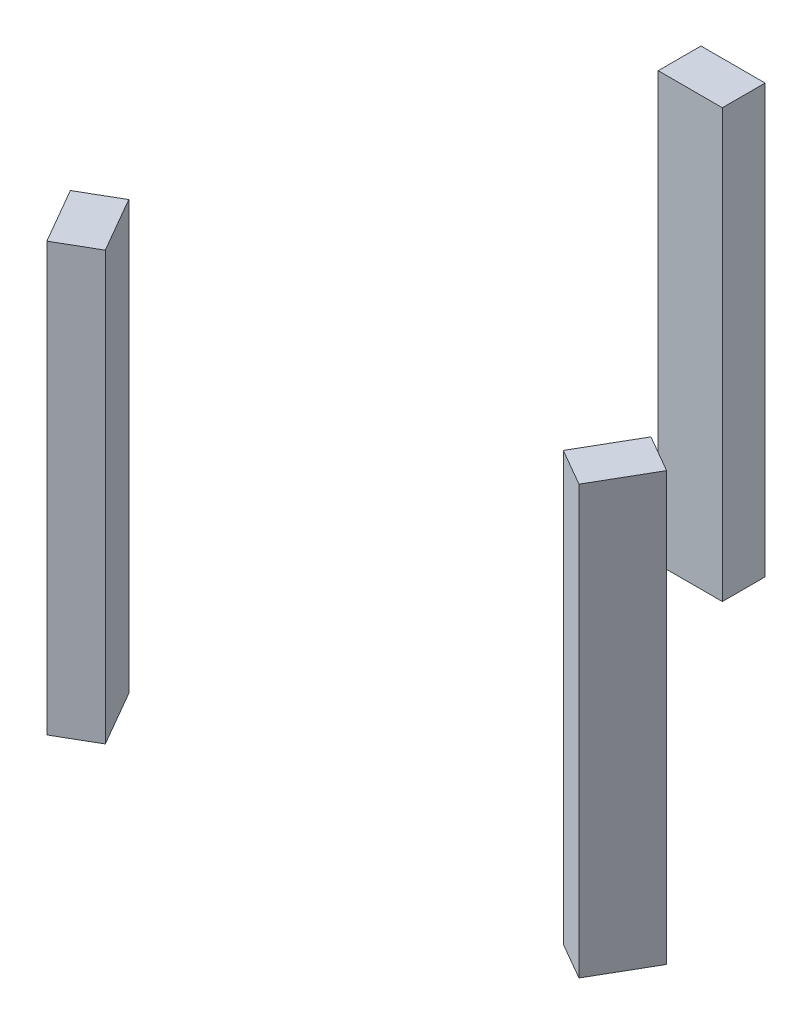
ISO-10303-21;
HEADER;
FILE_DESCRIPTION(('STEP AP214'),'2;1');
FILE_NAME('part.step','',(''),(''),'','','');
FILE_SCHEMA(('AUTOMOTIVE_DESIGN { 1 0 10303 214 1 1 1 1 }'));
ENDSEC;
DATA;
#1=APPLICATION_CONTEXT('core data for automotive mechanical design processes');
#2=APPLICATION_PROTOCOL_DEFINITION('international standard','automotive_design',2000,#1);
#3=PRODUCT_CONTEXT('',#1,'mechanical');
#4=PRODUCT('Part','Part','',(#3));
#5=PRODUCT_RELATED_PRODUCT_CATEGORY('part','',(#4));
#6=PRODUCT_DEFINITION_FORMATION('','',#4);
#7=PRODUCT_DEFINITION_CONTEXT('part definition',#1,'design');
#8=PRODUCT_DEFINITION('design','',#6,#7);
#9=PRODUCT_DEFINITION_SHAPE('','',#8);
#10=(LENGTH_UNIT() NAMED_UNIT(*) SI_UNIT(.MILLI.,.METRE.));
#11=(NAMED_UNIT(*) PLANE_ANGLE_UNIT() SI_UNIT($,.RADIAN.));
#12=(NAMED_UNIT(*) SI_UNIT($,.STERADIAN.) SOLID_ANGLE_UNIT());
#13=UNCERTAINTY_MEASURE_WITH_UNIT(LENGTH_MEASURE(1.E-05),#10,'distance_accuracy_value','');
#14=(GEOMETRIC_REPRESENTATION_CONTEXT(3) GLOBAL_UNCERTAINTY_ASSIGNED_CONTEXT((#13)) GLOBAL_UNIT_ASSIGNED_CONTEXT((#10,
#11,#12)) REPRESENTATION_CONTEXT('',''));
#15=CARTESIAN_POINT('',(0.,0.,0.));
#16=DIRECTION('',(0.,0.,1.));
#17=DIRECTION('',(1.,0.,0.));
#18=AXIS2_PLACEMENT_3D('',#15,#16,#17);
#19=CARTESIAN_POINT('',(133.923048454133,200.,42.67949192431));
#20=DIRECTION('',(0.499999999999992,0.,-0.866025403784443));
#21=DIRECTION('',(-0.866025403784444,0.,-0.499999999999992));
#22=AXIS2_PLACEMENT_3D('',#19,#20,#21);
#23=PLANE('',#22);
#24=DIRECTION('',(0.866025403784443,0.,0.499999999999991));
#25=VECTOR('',#24,1.);
#26=CARTESIAN_POINT('',(133.923048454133,0.,42.67949192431));
#27=LINE('',#26,#25);
#28=CARTESIAN_POINT('',(116.602540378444,0.,32.6794919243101));
#29=VERTEX_POINT('',#28);
#30=CARTESIAN_POINT('',(133.923048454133,0.,42.67949192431));
#31=VERTEX_POINT('',#30);
#32=EDGE_CURVE('E108',#29,#31,#27,.T.);
#33=ORIENTED_EDGE('',*,*,#32,.F.);
#34=DIRECTION('',(0.,-1.,0.));
#35=VECTOR('',#34,1.);
#36=CARTESIAN_POINT('',(116.602540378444,200.,32.6794919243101));
#37=LINE('',#36,#35);
#38=CARTESIAN_POINT('',(116.602540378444,200.,32.6794919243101));
#39=VERTEX_POINT('',#38);
#40=EDGE_CURVE('E12',#39,#29,#37,.T.);
#41=ORIENTED_EDGE('',*,*,#40,.F.);
#42=DIRECTION('',(0.866025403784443,0.,0.499999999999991));
#43=VECTOR('',#42,1.);
#44=CARTESIAN_POINT('',(133.923048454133,200.,42.67949192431));
#45=LINE('',#44,#43);
#46=CARTESIAN_POINT('',(133.923048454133,200.,42.67949192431));
#47=VERTEX_POINT('',#46);
#48=EDGE_CURVE('E102',#39,#47,#45,.T.);
#49=ORIENTED_EDGE('',*,*,#48,.T.);
#50=DIRECTION('',(0.,-1.,0.));
#51=VECTOR('',#50,1.);
#52=CARTESIAN_POINT('',(133.923048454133,200.,42.67949192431));
#53=LINE('',#52,#51);
#54=EDGE_CURVE('E47',#47,#31,#53,.T.);
#55=ORIENTED_EDGE('',*,*,#54,.T.);
#56=EDGE_LOOP('',(#33,#41,#49,#55));
#57=FACE_BOUND('',#56,.T.);
#58=ADVANCED_FACE('F44',(#57),#23,.T.);
#59=CARTESIAN_POINT('',(101.602540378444,200.,58.6602540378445));
#60=DIRECTION('',(-0.866025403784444,0.,-0.49999999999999));
#61=DIRECTION('',(-0.49999999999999,0.,0.866025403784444));
#62=AXIS2_PLACEMENT_3D('',#59,#60,#61);
#63=PLANE('',#62);
#64=DIRECTION('',(0.49999999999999,0.,-0.866025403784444));
#65=VECTOR('',#64,1.);
#66=CARTESIAN_POINT('',(101.602540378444,0.,58.6602540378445));
#67=LINE('',#66,#65);
#68=CARTESIAN_POINT('',(101.602540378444,0.,58.6602540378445));
#69=VERTEX_POINT('',#68);
#70=EDGE_CURVE('E104',#69,#29,#67,.T.);
#71=ORIENTED_EDGE('',*,*,#70,.F.);
#72=DIRECTION('',(0.,-1.,0.));
#73=VECTOR('',#72,1.);
#74=CARTESIAN_POINT('',(101.602540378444,200.,58.6602540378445));
#75=LINE('',#74,#73);
#76=CARTESIAN_POINT('',(101.602540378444,200.,58.6602540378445));
#77=VERTEX_POINT('',#76);
#78=EDGE_CURVE('E53',#77,#69,#75,.T.);
#79=ORIENTED_EDGE('',*,*,#78,.F.);
#80=DIRECTION('',(0.49999999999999,0.,-0.866025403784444));
#81=VECTOR('',#80,1.);
#82=CARTESIAN_POINT('',(101.602540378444,200.,58.6602540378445));
#83=LINE('',#82,#81);
#84=EDGE_CURVE('E99',#77,#39,#83,.T.);
#85=ORIENTED_EDGE('',*,*,#84,.T.);
#86=ORIENTED_EDGE('',*,*,#40,.T.);
#87=EDGE_LOOP('',(#71,#79,#85,#86));
#88=FACE_BOUND('',#87,.T.);
#89=ADVANCED_FACE('F118',(#88),#63,.T.);
#90=CARTESIAN_POINT('',(118.923048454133,200.,68.6602540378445));
#91=DIRECTION('',(-0.5,0.,0.866025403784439));
#92=DIRECTION('',(0.866025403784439,0.,0.5));
#93=AXIS2_PLACEMENT_3D('',#90,#91,#92);
#94=PLANE('',#93);
#95=DIRECTION('',(-0.866025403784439,0.,-0.5));
#96=VECTOR('',#95,1.);
#97=CARTESIAN_POINT('',(118.923048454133,0.,68.6602540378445));
#98=LINE('',#97,#96);
#99=CARTESIAN_POINT('',(118.923048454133,0.,68.6602540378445));
#100=VERTEX_POINT('',#99);
#101=EDGE_CURVE('E94',#100,#69,#98,.T.);
#102=ORIENTED_EDGE('',*,*,#101,.F.);
#103=DIRECTION('',(0.,-1.,0.));
#104=VECTOR('',#103,1.);
#105=CARTESIAN_POINT('',(118.923048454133,200.,68.6602540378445));
#106=LINE('',#105,#104);
#107=CARTESIAN_POINT('',(118.923048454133,200.,68.6602540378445));
#108=VERTEX_POINT('',#107);
#109=EDGE_CURVE('E89',#108,#100,#106,.T.);
#110=ORIENTED_EDGE('',*,*,#109,.F.);
#111=DIRECTION('',(-0.866025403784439,0.,-0.5));
#112=VECTOR('',#111,1.);
#113=CARTESIAN_POINT('',(118.923048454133,200.,68.6602540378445));
#114=LINE('',#113,#112);
#115=EDGE_CURVE('E92',#108,#77,#114,.T.);
#116=ORIENTED_EDGE('',*,*,#115,.T.);
#117=ORIENTED_EDGE('',*,*,#78,.T.);
#118=EDGE_LOOP('',(#102,#110,#116,#117));
#119=FACE_BOUND('',#118,.T.);
#120=ADVANCED_FACE('F91',(#119),#94,.T.);
#121=CARTESIAN_POINT('',(118.923048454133,200.,68.6602540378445));
#122=DIRECTION('',(0.866025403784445,0.,0.499999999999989));
#123=DIRECTION('',(0.49999999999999,0.,-0.866025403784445));
#124=AXIS2_PLACEMENT_3D('',#121,#122,#123);
#125=PLANE('',#124);
#126=DIRECTION('',(-0.49999999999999,0.,0.866025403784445));
#127=VECTOR('',#126,1.);
#128=CARTESIAN_POINT('',(118.923048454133,0.,68.6602540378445));
#129=LINE('',#128,#127);
#130=EDGE_CURVE('E111',#31,#100,#129,.T.);
#131=ORIENTED_EDGE('',*,*,#130,.F.);
#132=ORIENTED_EDGE('',*,*,#54,.F.);
#133=DIRECTION('',(-0.49999999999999,0.,0.866025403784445));
#134=VECTOR('',#133,1.);
#135=CARTESIAN_POINT('',(118.923048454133,200.,68.6602540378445));
#136=LINE('',#135,#134);
#137=EDGE_CURVE('E98',#47,#108,#136,.T.);
#138=ORIENTED_EDGE('',*,*,#137,.T.);
#139=ORIENTED_EDGE('',*,*,#109,.T.);
#140=EDGE_LOOP('',(#131,#132,#138,#139));
#141=FACE_BOUND('',#140,.T.);
#142=ADVANCED_FACE('F101',(#141),#125,.T.);
#143=CARTESIAN_POINT('',(0.,200.,0.));
#144=DIRECTION('',(0.,-1.,0.));
#145=DIRECTION('',(0.,0.,-1.));
#146=AXIS2_PLACEMENT_3D('',#143,#144,#145);
#147=PLANE('',#146);
#148=ORIENTED_EDGE('',*,*,#48,.F.);
#149=ORIENTED_EDGE('',*,*,#84,.F.);
#150=ORIENTED_EDGE('',*,*,#115,.F.);
#151=ORIENTED_EDGE('',*,*,#137,.F.);
#152=EDGE_LOOP('',(#148,#149,#150,#151));
#153=FACE_BOUND('',#152,.T.);
#154=ADVANCED_FACE('F97',(#153),#147,.F.);
#155=CARTESIAN_POINT('',(0.,0.,0.));
#156=DIRECTION('',(0.,-1.,0.));
#157=DIRECTION('',(0.,0.,-1.));
#158=AXIS2_PLACEMENT_3D('',#155,#156,#157);
#159=PLANE('',#158);
#160=ORIENTED_EDGE('',*,*,#32,.T.);
#161=ORIENTED_EDGE('',*,*,#130,.T.);
#162=ORIENTED_EDGE('',*,*,#101,.T.);
#163=ORIENTED_EDGE('',*,*,#70,.T.);
#164=EDGE_LOOP('',(#160,#161,#162,#163));
#165=FACE_BOUND('',#164,.T.);
#166=ADVANCED_FACE('F117',(#165),#159,.T.);
#167=CLOSED_SHELL('',(#58,#89,#120,#142,#154,#166));
#168=MANIFOLD_SOLID_BREP('B2',#167);
#169=CARTESIAN_POINT('',(-103.923048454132,200.,94.6410161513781));
#170=DIRECTION('',(0.500000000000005,0.,0.866025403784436));
#171=DIRECTION('',(0.866025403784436,0.,-0.500000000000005));
#172=AXIS2_PLACEMENT_3D('',#169,#170,#171);
#173=PLANE('',#172);
#174=DIRECTION('',(-0.866025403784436,0.,0.500000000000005));
#175=VECTOR('',#174,1.);
#176=CARTESIAN_POINT('',(-103.923048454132,0.,94.6410161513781));
#177=LINE('',#176,#175);
#178=CARTESIAN_POINT('',(-86.6025403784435,0.,84.641016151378));
#179=VERTEX_POINT('',#178);
#180=CARTESIAN_POINT('',(-103.923048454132,0.,94.6410161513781));
#181=VERTEX_POINT('',#180);
#182=EDGE_CURVE('E241',#179,#181,#177,.T.);
#183=ORIENTED_EDGE('',*,*,#182,.F.);
#184=DIRECTION('',(0.,-1.,0.));
#185=VECTOR('',#184,1.);
#186=CARTESIAN_POINT('',(-86.6025403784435,200.,84.641016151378));
#187=LINE('',#186,#185);
#188=CARTESIAN_POINT('',(-86.6025403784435,200.,84.641016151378));
#189=VERTEX_POINT('',#188);
#190=EDGE_CURVE('E42',#189,#179,#187,.T.);
#191=ORIENTED_EDGE('',*,*,#190,.F.);
#192=DIRECTION('',(-0.866025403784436,0.,0.500000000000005));
#193=VECTOR('',#192,1.);
#194=CARTESIAN_POINT('',(-103.923048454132,200.,94.6410161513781));
#195=LINE('',#194,#193);
#196=CARTESIAN_POINT('',(-103.923048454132,200.,94.6410161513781));
#197=VERTEX_POINT('',#196);
#198=EDGE_CURVE('E235',#189,#197,#195,.T.);
#199=ORIENTED_EDGE('',*,*,#198,.T.);
#200=DIRECTION('',(0.,-1.,0.));
#201=VECTOR('',#200,1.);
#202=CARTESIAN_POINT('',(-103.923048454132,200.,94.6410161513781));
#203=LINE('',#202,#201);
#204=EDGE_CURVE('E180',#197,#181,#203,.T.);
#205=ORIENTED_EDGE('',*,*,#204,.T.);
#206=EDGE_LOOP('',(#183,#191,#199,#205));
#207=FACE_BOUND('',#206,.T.);
#208=ADVANCED_FACE('F177',(#207),#173,.T.);
#209=CARTESIAN_POINT('',(-101.602540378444,200.,58.6602540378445));
#210=DIRECTION('',(0.866025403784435,0.,-0.500000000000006));
#211=DIRECTION('',(-0.500000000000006,0.,-0.866025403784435));
#212=AXIS2_PLACEMENT_3D('',#209,#210,#211);
#213=PLANE('',#212);
#214=DIRECTION('',(0.500000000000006,0.,0.866025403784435));
#215=VECTOR('',#214,1.);
#216=CARTESIAN_POINT('',(-101.602540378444,0.,58.6602540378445));
#217=LINE('',#216,#215);
#218=CARTESIAN_POINT('',(-101.602540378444,0.,58.6602540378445));
#219=VERTEX_POINT('',#218);
#220=EDGE_CURVE('E237',#219,#179,#217,.T.);
#221=ORIENTED_EDGE('',*,*,#220,.F.);
#222=DIRECTION('',(0.,-1.,0.));
#223=VECTOR('',#222,1.);
#224=CARTESIAN_POINT('',(-101.602540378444,200.,58.6602540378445));
#225=LINE('',#224,#223);
#226=CARTESIAN_POINT('',(-101.602540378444,200.,58.6602540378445));
#227=VERTEX_POINT('',#226);
#228=EDGE_CURVE('E186',#227,#219,#225,.T.);
#229=ORIENTED_EDGE('',*,*,#228,.F.);
#230=DIRECTION('',(0.500000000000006,0.,0.866025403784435));
#231=VECTOR('',#230,1.);
#232=CARTESIAN_POINT('',(-101.602540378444,200.,58.6602540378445));
#233=LINE('',#232,#231);
#234=EDGE_CURVE('E232',#227,#189,#233,.T.);
#235=ORIENTED_EDGE('',*,*,#234,.T.);
#236=ORIENTED_EDGE('',*,*,#190,.T.);
#237=EDGE_LOOP('',(#221,#229,#235,#236));
#238=FACE_BOUND('',#237,.T.);
#239=ADVANCED_FACE('F251',(#238),#213,.T.);
#240=CARTESIAN_POINT('',(-118.923048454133,200.,68.6602540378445));
#241=DIRECTION('',(-0.5,0.,-0.866025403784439));
#242=DIRECTION('',(-0.866025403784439,0.,0.5));
#243=AXIS2_PLACEMENT_3D('',#240,#241,#242);
#244=PLANE('',#243);
#245=DIRECTION('',(0.866025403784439,0.,-0.5));
#246=VECTOR('',#245,1.);
#247=CARTESIAN_POINT('',(-118.923048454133,0.,68.6602540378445));
#248=LINE('',#247,#246);
#249=CARTESIAN_POINT('',(-118.923048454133,0.,68.6602540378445));
#250=VERTEX_POINT('',#249);
#251=EDGE_CURVE('E227',#250,#219,#248,.T.);
#252=ORIENTED_EDGE('',*,*,#251,.F.);
#253=DIRECTION('',(0.,-1.,0.));
#254=VECTOR('',#253,1.);
#255=CARTESIAN_POINT('',(-118.923048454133,200.,68.6602540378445));
#256=LINE('',#255,#254);
#257=CARTESIAN_POINT('',(-118.923048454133,200.,68.6602540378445));
#258=VERTEX_POINT('',#257);
#259=EDGE_CURVE('E222',#258,#250,#256,.T.);
#260=ORIENTED_EDGE('',*,*,#259,.F.);
#261=DIRECTION('',(0.866025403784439,0.,-0.5));
#262=VECTOR('',#261,1.);
#263=CARTESIAN_POINT('',(-118.923048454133,200.,68.6602540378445));
#264=LINE('',#263,#262);
#265=EDGE_CURVE('E225',#258,#227,#264,.T.);
#266=ORIENTED_EDGE('',*,*,#265,.T.);
#267=ORIENTED_EDGE('',*,*,#228,.T.);
#268=EDGE_LOOP('',(#252,#260,#266,#267));
#269=FACE_BOUND('',#268,.T.);
#270=ADVANCED_FACE('F224',(#269),#244,.T.);
#271=CARTESIAN_POINT('',(-118.923048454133,200.,68.6602540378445));
#272=DIRECTION('',(-0.866025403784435,0.,0.500000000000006));
#273=DIRECTION('',(0.500000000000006,0.,0.866025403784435));
#274=AXIS2_PLACEMENT_3D('',#271,#272,#273);
#275=PLANE('',#274);
#276=DIRECTION('',(-0.500000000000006,0.,-0.866025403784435));
#277=VECTOR('',#276,1.);
#278=CARTESIAN_POINT('',(-118.923048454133,0.,68.6602540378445));
#279=LINE('',#278,#277);
#280=EDGE_CURVE('E244',#181,#250,#279,.T.);
#281=ORIENTED_EDGE('',*,*,#280,.F.);
#282=ORIENTED_EDGE('',*,*,#204,.F.);
#283=DIRECTION('',(-0.500000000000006,0.,-0.866025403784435));
#284=VECTOR('',#283,1.);
#285=CARTESIAN_POINT('',(-118.923048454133,200.,68.6602540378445));
#286=LINE('',#285,#284);
#287=EDGE_CURVE('E231',#197,#258,#286,.T.);
#288=ORIENTED_EDGE('',*,*,#287,.T.);
#289=ORIENTED_EDGE('',*,*,#259,.T.);
#290=EDGE_LOOP('',(#281,#282,#288,#289));
#291=FACE_BOUND('',#290,.T.);
#292=ADVANCED_FACE('F234',(#291),#275,.T.);
#293=CARTESIAN_POINT('',(0.,200.,0.));
#294=DIRECTION('',(0.,-1.,0.));
#295=DIRECTION('',(0.,0.,-1.));
#296=AXIS2_PLACEMENT_3D('',#293,#294,#295);
#297=PLANE('',#296);
#298=ORIENTED_EDGE('',*,*,#198,.F.);
#299=ORIENTED_EDGE('',*,*,#234,.F.);
#300=ORIENTED_EDGE('',*,*,#265,.F.);
#301=ORIENTED_EDGE('',*,*,#287,.F.);
#302=EDGE_LOOP('',(#298,#299,#300,#301));
#303=FACE_BOUND('',#302,.T.);
#304=ADVANCED_FACE('F230',(#303),#297,.F.);
#305=CARTESIAN_POINT('',(0.,0.,0.));
#306=DIRECTION('',(0.,-1.,0.));
#307=DIRECTION('',(0.,0.,-1.));
#308=AXIS2_PLACEMENT_3D('',#305,#306,#307);
#309=PLANE('',#308);
#310=ORIENTED_EDGE('',*,*,#182,.T.);
#311=ORIENTED_EDGE('',*,*,#280,.T.);
#312=ORIENTED_EDGE('',*,*,#251,.T.);
#313=ORIENTED_EDGE('',*,*,#220,.T.);
#314=EDGE_LOOP('',(#310,#311,#312,#313));
#315=FACE_BOUND('',#314,.T.);
#316=ADVANCED_FACE('F250',(#315),#309,.T.);
#317=CLOSED_SHELL('',(#208,#239,#270,#292,#304,#316));
#318=MANIFOLD_SOLID_BREP('B6',#317);
#319=CARTESIAN_POINT('',(-30.,200.,-137.320508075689));
#320=DIRECTION('',(-1.,0.,0.));
#321=DIRECTION('',(0.,0.,1.));
#322=AXIS2_PLACEMENT_3D('',#319,#320,#321);
#323=PLANE('',#322);
#324=DIRECTION('',(0.,0.,-1.));
#325=VECTOR('',#324,1.);
#326=CARTESIAN_POINT('',(-30.,0.,-137.320508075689));
#327=LINE('',#326,#325);
#328=CARTESIAN_POINT('',(-30.,0.,-117.320508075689));
#329=VERTEX_POINT('',#328);
#330=CARTESIAN_POINT('',(-30.,0.,-137.320508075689));
#331=VERTEX_POINT('',#330);
#332=EDGE_CURVE('E365',#329,#331,#327,.T.);
#333=ORIENTED_EDGE('',*,*,#332,.F.);
#334=DIRECTION('',(0.,-1.,0.));
#335=VECTOR('',#334,1.);
#336=CARTESIAN_POINT('',(-30.,200.,-117.320508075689));
#337=LINE('',#336,#335);
#338=CARTESIAN_POINT('',(-30.,200.,-117.320508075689));
#339=VERTEX_POINT('',#338);
#340=EDGE_CURVE('E175',#339,#329,#337,.T.);
#341=ORIENTED_EDGE('',*,*,#340,.F.);
#342=DIRECTION('',(0.,0.,-1.));
#343=VECTOR('',#342,1.);
#344=CARTESIAN_POINT('',(-30.,200.,-137.320508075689));
#345=LINE('',#344,#343);
#346=CARTESIAN_POINT('',(-30.,200.,-137.320508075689));
#347=VERTEX_POINT('',#346);
#348=EDGE_CURVE('E359',#339,#347,#345,.T.);
#349=ORIENTED_EDGE('',*,*,#348,.T.);
#350=DIRECTION('',(0.,-1.,0.));
#351=VECTOR('',#350,1.);
#352=CARTESIAN_POINT('',(-30.,200.,-137.320508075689));
#353=LINE('',#352,#351);
#354=EDGE_CURVE('E304',#347,#331,#353,.T.);
#355=ORIENTED_EDGE('',*,*,#354,.T.);
#356=EDGE_LOOP('',(#333,#341,#349,#355));
#357=FACE_BOUND('',#356,.T.);
#358=ADVANCED_FACE('F301',(#357),#323,.T.);
#359=CARTESIAN_POINT('',(0.,200.,-117.320508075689));
#360=DIRECTION('',(0.,0.,1.));
#361=DIRECTION('',(1.,0.,0.));
#362=AXIS2_PLACEMENT_3D('',#359,#360,#361);
#363=PLANE('',#362);
#364=DIRECTION('',(-1.,0.,0.));
#365=VECTOR('',#364,1.);
#366=CARTESIAN_POINT('',(0.,0.,-117.320508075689));
#367=LINE('',#366,#365);
#368=CARTESIAN_POINT('',(0.,0.,-117.320508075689));
#369=VERTEX_POINT('',#368);
#370=EDGE_CURVE('E361',#369,#329,#367,.T.);
#371=ORIENTED_EDGE('',*,*,#370,.F.);
#372=DIRECTION('',(0.,-1.,0.));
#373=VECTOR('',#372,1.);
#374=CARTESIAN_POINT('',(0.,200.,-117.320508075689));
#375=LINE('',#374,#373);
#376=CARTESIAN_POINT('',(0.,200.,-117.320508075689));
#377=VERTEX_POINT('',#376);
#378=EDGE_CURVE('E310',#377,#369,#375,.T.);
#379=ORIENTED_EDGE('',*,*,#378,.F.);
#380=DIRECTION('',(-1.,0.,0.));
#381=VECTOR('',#380,1.);
#382=CARTESIAN_POINT('',(0.,200.,-117.320508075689));
#383=LINE('',#382,#381);
#384=EDGE_CURVE('E356',#377,#339,#383,.T.);
#385=ORIENTED_EDGE('',*,*,#384,.T.);
#386=ORIENTED_EDGE('',*,*,#340,.T.);
#387=EDGE_LOOP('',(#371,#379,#385,#386));
#388=FACE_BOUND('',#387,.T.);
#389=ADVANCED_FACE('F375',(#388),#363,.T.);
#390=CARTESIAN_POINT('',(0.,200.,-137.320508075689));
#391=DIRECTION('',(1.,0.,0.));
#392=DIRECTION('',(0.,0.,-1.));
#393=AXIS2_PLACEMENT_3D('',#390,#391,#392);
#394=PLANE('',#393);
#395=DIRECTION('',(0.,0.,1.));
#396=VECTOR('',#395,1.);
#397=CARTESIAN_POINT('',(0.,0.,-137.320508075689));
#398=LINE('',#397,#396);
#399=CARTESIAN_POINT('',(0.,0.,-137.320508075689));
#400=VERTEX_POINT('',#399);
#401=EDGE_CURVE('E351',#400,#369,#398,.T.);
#402=ORIENTED_EDGE('',*,*,#401,.F.);
#403=DIRECTION('',(0.,-1.,0.));
#404=VECTOR('',#403,1.);
#405=CARTESIAN_POINT('',(0.,200.,-137.320508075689));
#406=LINE('',#405,#404);
#407=CARTESIAN_POINT('',(0.,200.,-137.320508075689));
#408=VERTEX_POINT('',#407);
#409=EDGE_CURVE('E346',#408,#400,#406,.T.);
#410=ORIENTED_EDGE('',*,*,#409,.F.);
#411=DIRECTION('',(0.,0.,1.));
#412=VECTOR('',#411,1.);
#413=CARTESIAN_POINT('',(0.,200.,-137.320508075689));
#414=LINE('',#413,#412);
#415=EDGE_CURVE('E349',#408,#377,#414,.T.);
#416=ORIENTED_EDGE('',*,*,#415,.T.);
#417=ORIENTED_EDGE('',*,*,#378,.T.);
#418=EDGE_LOOP('',(#402,#410,#416,#417));
#419=FACE_BOUND('',#418,.T.);
#420=ADVANCED_FACE('F348',(#419),#394,.T.);
#421=CARTESIAN_POINT('',(0.,200.,-137.320508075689));
#422=DIRECTION('',(0.,0.,-1.));
#423=DIRECTION('',(-1.,0.,0.));
#424=AXIS2_PLACEMENT_3D('',#421,#422,#423);
#425=PLANE('',#424);
#426=DIRECTION('',(1.,0.,0.));
#427=VECTOR('',#426,1.);
#428=CARTESIAN_POINT('',(0.,0.,-137.320508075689));
#429=LINE('',#428,#427);
#430=EDGE_CURVE('E368',#331,#400,#429,.T.);
#431=ORIENTED_EDGE('',*,*,#430,.F.);
#432=ORIENTED_EDGE('',*,*,#354,.F.);
#433=DIRECTION('',(1.,0.,0.));
#434=VECTOR('',#433,1.);
#435=CARTESIAN_POINT('',(0.,200.,-137.320508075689));
#436=LINE('',#435,#434);
#437=EDGE_CURVE('E355',#347,#408,#436,.T.);
#438=ORIENTED_EDGE('',*,*,#437,.T.);
#439=ORIENTED_EDGE('',*,*,#409,.T.);
#440=EDGE_LOOP('',(#431,#432,#438,#439));
#441=FACE_BOUND('',#440,.T.);
#442=ADVANCED_FACE('F358',(#441),#425,.T.);
#443=CARTESIAN_POINT('',(0.,200.,0.));
#444=DIRECTION('',(0.,-1.,0.));
#445=DIRECTION('',(0.,0.,-1.));
#446=AXIS2_PLACEMENT_3D('',#443,#444,#445);
#447=PLANE('',#446);
#448=ORIENTED_EDGE('',*,*,#348,.F.);
#449=ORIENTED_EDGE('',*,*,#384,.F.);
#450=ORIENTED_EDGE('',*,*,#415,.F.);
#451=ORIENTED_EDGE('',*,*,#437,.F.);
#452=EDGE_LOOP('',(#448,#449,#450,#451));
#453=FACE_BOUND('',#452,.T.);
#454=ADVANCED_FACE('F354',(#453),#447,.F.);
#455=CARTESIAN_POINT('',(0.,0.,0.));
#456=DIRECTION('',(0.,-1.,0.));
#457=DIRECTION('',(0.,0.,-1.));
#458=AXIS2_PLACEMENT_3D('',#455,#456,#457);
#459=PLANE('',#458);
#460=ORIENTED_EDGE('',*,*,#332,.T.);
#461=ORIENTED_EDGE('',*,*,#430,.T.);
#462=ORIENTED_EDGE('',*,*,#401,.T.);
#463=ORIENTED_EDGE('',*,*,#370,.T.);
#464=EDGE_LOOP('',(#460,#461,#462,#463));
#465=FACE_BOUND('',#464,.T.);
#466=ADVANCED_FACE('F374',(#465),#459,.T.);
#467=CLOSED_SHELL('',(#358,#389,#420,#442,#454,#466));
#468=MANIFOLD_SOLID_BREP('B36',#467);
#469=ADVANCED_BREP_SHAPE_REPRESENTATION('',(#18,#168,#318,#468),#14);
#470=SHAPE_DEFINITION_REPRESENTATION(#9,#469);
ENDSEC;
END-ISO-10303-21;
